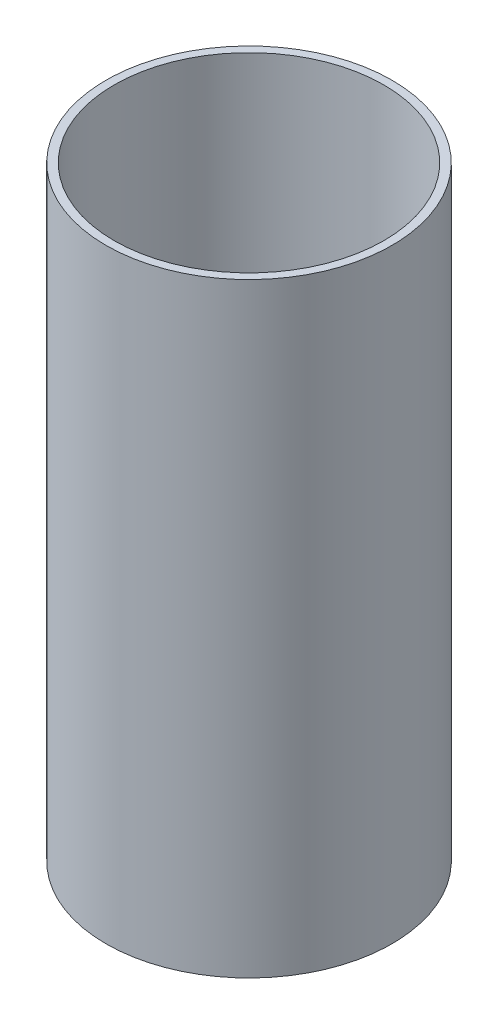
from build123d import *

# Parameters (mm, degrees)
SKETCH1_R           = 27.1526
SKETCH1_R_2         = 25.6032
EXTRUDE_THIN1_DEPTH = 114.808


with BuildPart() as part:
    # Sketch1 → Extrude-Thin1 (new body)
    with BuildSketch(Plane(origin=(0, 0, 0), x_dir=(1, 0, 0), z_dir=(0, 1, 0))):
        Circle(SKETCH1_R)
        Circle(SKETCH1_R_2, mode=Mode.SUBTRACT)
    extrude(amount=EXTRUDE_THIN1_DEPTH)


solid = part.part
